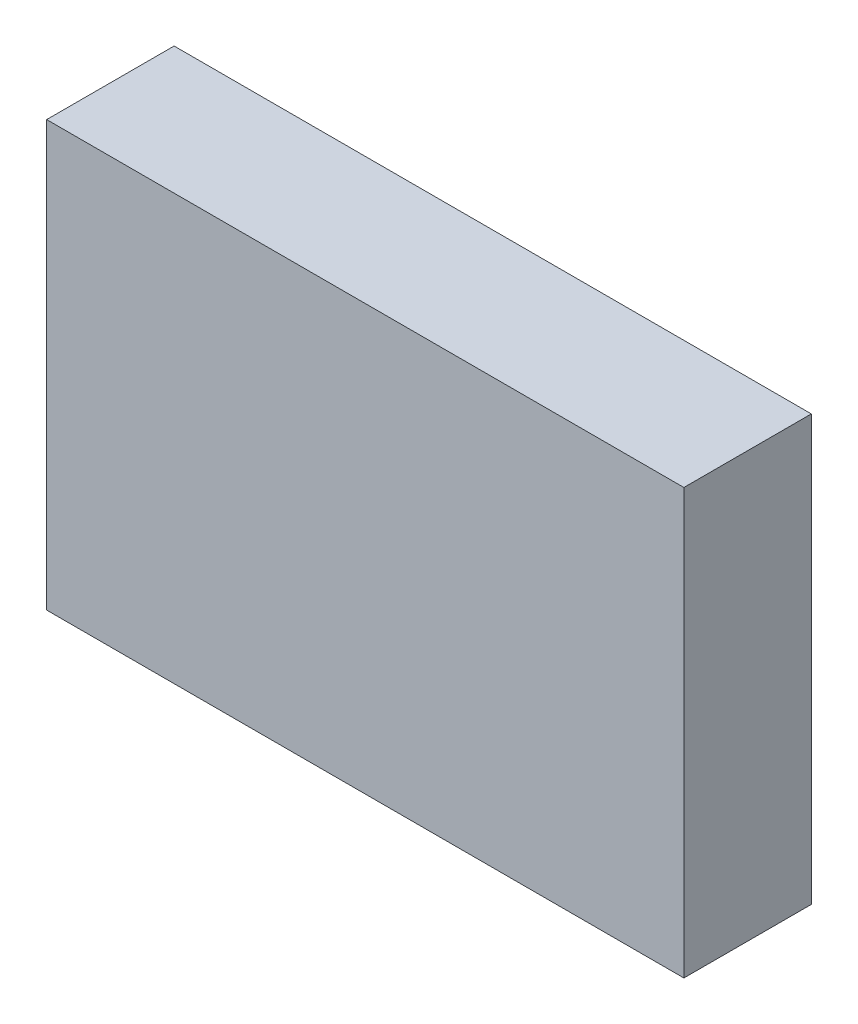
ISO-10303-21;
HEADER;
FILE_DESCRIPTION(('STEP AP214'),'2;1');
FILE_NAME('part.step','',(''),(''),'','','');
FILE_SCHEMA(('AUTOMOTIVE_DESIGN { 1 0 10303 214 1 1 1 1 }'));
ENDSEC;
DATA;
#1=APPLICATION_CONTEXT('core data for automotive mechanical design processes');
#2=APPLICATION_PROTOCOL_DEFINITION('international standard','automotive_design',2000,#1);
#3=PRODUCT_CONTEXT('',#1,'mechanical');
#4=PRODUCT('Part','Part','',(#3));
#5=PRODUCT_RELATED_PRODUCT_CATEGORY('part','',(#4));
#6=PRODUCT_DEFINITION_FORMATION('','',#4);
#7=PRODUCT_DEFINITION_CONTEXT('part definition',#1,'design');
#8=PRODUCT_DEFINITION('design','',#6,#7);
#9=PRODUCT_DEFINITION_SHAPE('','',#8);
#10=(LENGTH_UNIT() NAMED_UNIT(*) SI_UNIT(.MILLI.,.METRE.));
#11=(NAMED_UNIT(*) PLANE_ANGLE_UNIT() SI_UNIT($,.RADIAN.));
#12=(NAMED_UNIT(*) SI_UNIT($,.STERADIAN.) SOLID_ANGLE_UNIT());
#13=UNCERTAINTY_MEASURE_WITH_UNIT(LENGTH_MEASURE(1.E-05),#10,'distance_accuracy_value','');
#14=(GEOMETRIC_REPRESENTATION_CONTEXT(3) GLOBAL_UNCERTAINTY_ASSIGNED_CONTEXT((#13)) GLOBAL_UNIT_ASSIGNED_CONTEXT((#10,
#11,#12)) REPRESENTATION_CONTEXT('',''));
#15=CARTESIAN_POINT('',(0.,0.,0.));
#16=DIRECTION('',(0.,0.,1.));
#17=DIRECTION('',(1.,0.,0.));
#18=AXIS2_PLACEMENT_3D('',#15,#16,#17);
#19=CARTESIAN_POINT('',(-37.5,50.,7.50000000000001));
#20=DIRECTION('',(1.,0.,0.));
#21=DIRECTION('',(0.,0.,-1.));
#22=AXIS2_PLACEMENT_3D('',#19,#20,#21);
#23=PLANE('',#22);
#24=DIRECTION('',(0.,0.,1.));
#25=VECTOR('',#24,1.);
#26=CARTESIAN_POINT('',(-37.5,0.,7.50000000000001));
#27=LINE('',#26,#25);
#28=CARTESIAN_POINT('',(-37.5,0.,-7.49999999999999));
#29=VERTEX_POINT('',#28);
#30=CARTESIAN_POINT('',(-37.5,0.,7.50000000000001));
#31=VERTEX_POINT('',#30);
#32=EDGE_CURVE('E98',#29,#31,#27,.T.);
#33=ORIENTED_EDGE('',*,*,#32,.T.);
#34=DIRECTION('',(0.,-1.,0.));
#35=VECTOR('',#34,1.);
#36=CARTESIAN_POINT('',(-37.5,50.,7.50000000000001));
#37=LINE('',#36,#35);
#38=CARTESIAN_POINT('',(-37.5,50.,7.50000000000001));
#39=VERTEX_POINT('',#38);
#40=EDGE_CURVE('E11',#39,#31,#37,.T.);
#41=ORIENTED_EDGE('',*,*,#40,.F.);
#42=DIRECTION('',(0.,0.,1.));
#43=VECTOR('',#42,1.);
#44=CARTESIAN_POINT('',(-37.5,50.,7.50000000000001));
#45=LINE('',#44,#43);
#46=CARTESIAN_POINT('',(-37.5,50.,-7.49999999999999));
#47=VERTEX_POINT('',#46);
#48=EDGE_CURVE('E86',#47,#39,#45,.T.);
#49=ORIENTED_EDGE('',*,*,#48,.F.);
#50=DIRECTION('',(0.,-1.,0.));
#51=VECTOR('',#50,1.);
#52=CARTESIAN_POINT('',(-37.5,50.,-7.49999999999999));
#53=LINE('',#52,#51);
#54=EDGE_CURVE('E94',#47,#29,#53,.T.);
#55=ORIENTED_EDGE('',*,*,#54,.T.);
#56=EDGE_LOOP('',(#33,#41,#49,#55));
#57=FACE_BOUND('',#56,.T.);
#58=ADVANCED_FACE('F35',(#57),#23,.F.);
#59=CARTESIAN_POINT('',(37.5,50.,7.5));
#60=DIRECTION('',(0.,0.,-1.));
#61=DIRECTION('',(-1.,0.,0.));
#62=AXIS2_PLACEMENT_3D('',#59,#60,#61);
#63=PLANE('',#62);
#64=DIRECTION('',(1.,0.,0.));
#65=VECTOR('',#64,1.);
#66=CARTESIAN_POINT('',(37.5,0.,7.5));
#67=LINE('',#66,#65);
#68=CARTESIAN_POINT('',(37.5,0.,7.5));
#69=VERTEX_POINT('',#68);
#70=EDGE_CURVE('E90',#31,#69,#67,.T.);
#71=ORIENTED_EDGE('',*,*,#70,.T.);
#72=DIRECTION('',(0.,-1.,0.));
#73=VECTOR('',#72,1.);
#74=CARTESIAN_POINT('',(37.5,50.,7.5));
#75=LINE('',#74,#73);
#76=CARTESIAN_POINT('',(37.5,50.,7.5));
#77=VERTEX_POINT('',#76);
#78=EDGE_CURVE('E43',#77,#69,#75,.T.);
#79=ORIENTED_EDGE('',*,*,#78,.F.);
#80=DIRECTION('',(1.,0.,0.));
#81=VECTOR('',#80,1.);
#82=CARTESIAN_POINT('',(37.5,50.,7.5));
#83=LINE('',#82,#81);
#84=EDGE_CURVE('E81',#39,#77,#83,.T.);
#85=ORIENTED_EDGE('',*,*,#84,.F.);
#86=ORIENTED_EDGE('',*,*,#40,.T.);
#87=EDGE_LOOP('',(#71,#79,#85,#86));
#88=FACE_BOUND('',#87,.T.);
#89=ADVANCED_FACE('F89',(#88),#63,.F.);
#90=CARTESIAN_POINT('',(37.5,50.,7.5));
#91=DIRECTION('',(-1.,0.,0.));
#92=DIRECTION('',(0.,0.,1.));
#93=AXIS2_PLACEMENT_3D('',#90,#91,#92);
#94=PLANE('',#93);
#95=DIRECTION('',(0.,0.,-1.));
#96=VECTOR('',#95,1.);
#97=CARTESIAN_POINT('',(37.5,0.,7.5));
#98=LINE('',#97,#96);
#99=CARTESIAN_POINT('',(37.5,0.,-7.5));
#100=VERTEX_POINT('',#99);
#101=EDGE_CURVE('E68',#69,#100,#98,.T.);
#102=ORIENTED_EDGE('',*,*,#101,.T.);
#103=DIRECTION('',(0.,-1.,0.));
#104=VECTOR('',#103,1.);
#105=CARTESIAN_POINT('',(37.5,50.,-7.5));
#106=LINE('',#105,#104);
#107=CARTESIAN_POINT('',(37.5,50.,-7.5));
#108=VERTEX_POINT('',#107);
#109=EDGE_CURVE('E91',#108,#100,#106,.T.);
#110=ORIENTED_EDGE('',*,*,#109,.F.);
#111=DIRECTION('',(0.,0.,-1.));
#112=VECTOR('',#111,1.);
#113=CARTESIAN_POINT('',(37.5,50.,7.5));
#114=LINE('',#113,#112);
#115=EDGE_CURVE('E84',#77,#108,#114,.T.);
#116=ORIENTED_EDGE('',*,*,#115,.F.);
#117=ORIENTED_EDGE('',*,*,#78,.T.);
#118=EDGE_LOOP('',(#102,#110,#116,#117));
#119=FACE_BOUND('',#118,.T.);
#120=ADVANCED_FACE('F92',(#119),#94,.F.);
#121=CARTESIAN_POINT('',(37.5,50.,-7.5));
#122=DIRECTION('',(0.,0.,1.));
#123=DIRECTION('',(1.,0.,0.));
#124=AXIS2_PLACEMENT_3D('',#121,#122,#123);
#125=PLANE('',#124);
#126=DIRECTION('',(-1.,0.,0.));
#127=VECTOR('',#126,1.);
#128=CARTESIAN_POINT('',(37.5,0.,-7.5));
#129=LINE('',#128,#127);
#130=EDGE_CURVE('E74',#100,#29,#129,.T.);
#131=ORIENTED_EDGE('',*,*,#130,.T.);
#132=ORIENTED_EDGE('',*,*,#54,.F.);
#133=DIRECTION('',(-1.,0.,0.));
#134=VECTOR('',#133,1.);
#135=CARTESIAN_POINT('',(37.5,50.,-7.5));
#136=LINE('',#135,#134);
#137=EDGE_CURVE('E51',#108,#47,#136,.T.);
#138=ORIENTED_EDGE('',*,*,#137,.F.);
#139=ORIENTED_EDGE('',*,*,#109,.T.);
#140=EDGE_LOOP('',(#131,#132,#138,#139));
#141=FACE_BOUND('',#140,.T.);
#142=ADVANCED_FACE('F105',(#141),#125,.F.);
#143=CARTESIAN_POINT('',(0.,50.,0.));
#144=DIRECTION('',(0.,1.,0.));
#145=DIRECTION('',(0.,0.,1.));
#146=AXIS2_PLACEMENT_3D('',#143,#144,#145);
#147=PLANE('',#146);
#148=ORIENTED_EDGE('',*,*,#48,.T.);
#149=ORIENTED_EDGE('',*,*,#84,.T.);
#150=ORIENTED_EDGE('',*,*,#115,.T.);
#151=ORIENTED_EDGE('',*,*,#137,.T.);
#152=EDGE_LOOP('',(#148,#149,#150,#151));
#153=FACE_BOUND('',#152,.T.);
#154=ADVANCED_FACE('F82',(#153),#147,.T.);
#155=CARTESIAN_POINT('',(0.,0.,0.));
#156=DIRECTION('',(0.,1.,0.));
#157=DIRECTION('',(0.,0.,1.));
#158=AXIS2_PLACEMENT_3D('',#155,#156,#157);
#159=PLANE('',#158);
#160=ORIENTED_EDGE('',*,*,#32,.F.);
#161=ORIENTED_EDGE('',*,*,#130,.F.);
#162=ORIENTED_EDGE('',*,*,#101,.F.);
#163=ORIENTED_EDGE('',*,*,#70,.F.);
#164=EDGE_LOOP('',(#160,#161,#162,#163));
#165=FACE_BOUND('',#164,.T.);
#166=ADVANCED_FACE('F108',(#165),#159,.F.);
#167=CLOSED_SHELL('',(#58,#89,#120,#142,#154,#166));
#168=MANIFOLD_SOLID_BREP('B2',#167);
#169=ADVANCED_BREP_SHAPE_REPRESENTATION('',(#18,#168),#14);
#170=SHAPE_DEFINITION_REPRESENTATION(#9,#169);
ENDSEC;
END-ISO-10303-21;
